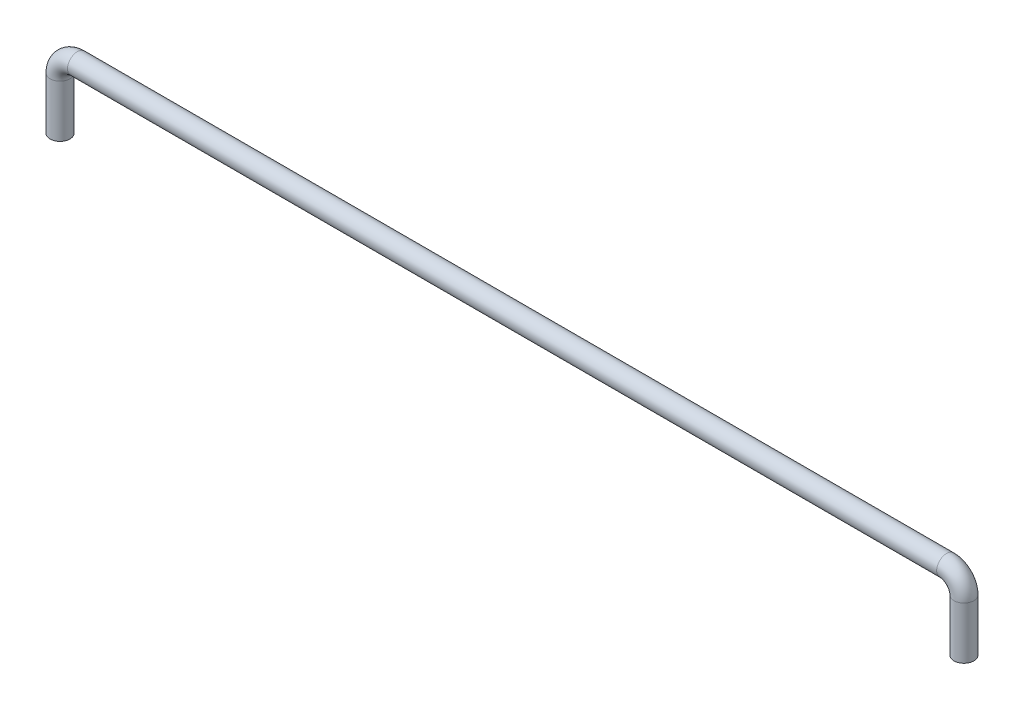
from build123d import *

# Parameters (mm, degrees)
SKETCH2_R = 1.45


with BuildPart() as part:
    # Sweep1: sweep along a path in Sketch1
    with BuildLine(Plane.XY) as sweep1_path:
        Line((0, 0), (0, 7.62))
        ThreePointArc((0, 7.62), (0.743948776, 9.416051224), (2.54, 10.16))
        Line((2.54, 10.16), (129.54, 10.16))
        ThreePointArc((129.54, 10.16), (131.336051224, 9.416051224), (132.08, 7.62))
        Line((132.08, 7.62), (132.08, 0))
    # Sketch2 → Sweep1 (sweep)
    with BuildSketch(Plane(origin=(0, 0, 0), x_dir=(1, 0, 0), z_dir=(0, 1, 0))):
        Circle(SKETCH2_R)
    sweep(path=sweep1_path.line)


solid = part.part
